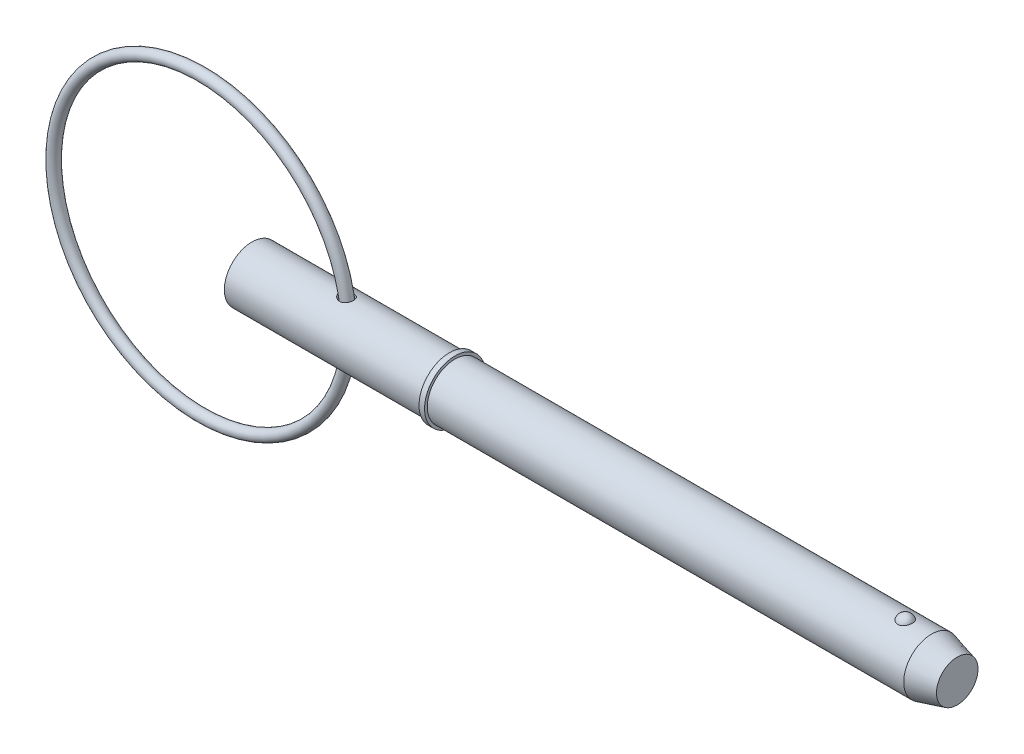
ISO-10303-21;
HEADER;
FILE_DESCRIPTION(('STEP AP214'),'2;1');
FILE_NAME('part.step','',(''),(''),'','','');
FILE_SCHEMA(('AUTOMOTIVE_DESIGN { 1 0 10303 214 1 1 1 1 }'));
ENDSEC;
DATA;
#1=APPLICATION_CONTEXT('core data for automotive mechanical design processes');
#2=APPLICATION_PROTOCOL_DEFINITION('international standard','automotive_design',2000,#1);
#3=PRODUCT_CONTEXT('',#1,'mechanical');
#4=PRODUCT('Part','Part','',(#3));
#5=PRODUCT_RELATED_PRODUCT_CATEGORY('part','',(#4));
#6=PRODUCT_DEFINITION_FORMATION('','',#4);
#7=PRODUCT_DEFINITION_CONTEXT('part definition',#1,'design');
#8=PRODUCT_DEFINITION('design','',#6,#7);
#9=PRODUCT_DEFINITION_SHAPE('','',#8);
#10=(LENGTH_UNIT() NAMED_UNIT(*) SI_UNIT(.MILLI.,.METRE.));
#11=(NAMED_UNIT(*) PLANE_ANGLE_UNIT() SI_UNIT($,.RADIAN.));
#12=(NAMED_UNIT(*) SI_UNIT($,.STERADIAN.) SOLID_ANGLE_UNIT());
#13=UNCERTAINTY_MEASURE_WITH_UNIT(LENGTH_MEASURE(1.E-05),#10,'distance_accuracy_value','');
#14=(GEOMETRIC_REPRESENTATION_CONTEXT(3) GLOBAL_UNCERTAINTY_ASSIGNED_CONTEXT((#13)) GLOBAL_UNIT_ASSIGNED_CONTEXT((#10,
#11,#12)) REPRESENTATION_CONTEXT('',''));
#15=CARTESIAN_POINT('',(0.,0.,0.));
#16=DIRECTION('',(0.,0.,1.));
#17=DIRECTION('',(1.,0.,0.));
#18=AXIS2_PLACEMENT_3D('',#15,#16,#17);
#19=CARTESIAN_POINT('',(-4.3552379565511,0.,0.));
#20=DIRECTION('',(0.,0.,1.));
#21=DIRECTION('',(1.,0.,0.));
#22=AXIS2_PLACEMENT_3D('',#19,#20,#21);
#23=TOROIDAL_SURFACE('',#22,12.7,0.476000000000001);
#24=CARTESIAN_POINT('',(8.8207620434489,0.,0.));
#25=VERTEX_POINT('',#24);
#26=VERTEX_LOOP('',#25);
#27=FACE_BOUND('',#26,.T.);
#28=ADVANCED_FACE('P0_F12',(#27),#23,.T.);
#29=CLOSED_SHELL('',(#28));
#30=MANIFOLD_SOLID_BREP('P0_B1',#29);
#31=CARTESIAN_POINT('',(0.,0.,0.));
#32=DIRECTION('',(1.,0.,0.));
#33=DIRECTION('',(0.,0.,-1.));
#34=AXIS2_PLACEMENT_3D('',#31,#32,#33);
#35=CYLINDRICAL_SURFACE('',#34,2.38);
#36=CARTESIAN_POINT('',(7.65248265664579,2.35074198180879,-0.372037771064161));
#37=CARTESIAN_POINT('',(7.67546616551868,2.34644965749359,-0.399158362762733));
#38=CARTESIAN_POINT('',(7.70081651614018,2.34199234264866,-0.424274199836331));
#39=CARTESIAN_POINT('',(7.75542747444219,2.33326580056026,-0.46990771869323));
#40=CARTESIAN_POINT('',(7.78469342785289,2.32899684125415,-0.49041900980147));
#41=CARTESIAN_POINT('',(7.8462833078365,2.32114904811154,-0.526312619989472));
#42=CARTESIAN_POINT('',(7.87860537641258,2.31756979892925,-0.541698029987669));
#43=CARTESIAN_POINT('',(7.9454452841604,2.31153734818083,-0.566889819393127));
#44=CARTESIAN_POINT('',(7.97996214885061,2.30908365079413,-0.576698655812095));
#45=CARTESIAN_POINT('',(8.05000735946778,2.30564492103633,-0.590297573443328));
#46=CARTESIAN_POINT('',(8.0855275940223,2.30465036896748,-0.594126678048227));
#47=CARTESIAN_POINT('',(8.15670718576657,2.30426876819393,-0.595606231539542));
#48=CARTESIAN_POINT('',(8.1923664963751,2.30488122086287,-0.593258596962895));
#49=CARTESIAN_POINT('',(8.26077822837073,2.30759475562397,-0.582609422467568));
#50=CARTESIAN_POINT('',(8.29358437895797,2.30961492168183,-0.574631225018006));
#51=CARTESIAN_POINT('',(8.35727060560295,2.31483318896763,-0.553233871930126));
#52=CARTESIAN_POINT('',(8.38815097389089,2.31803111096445,-0.53981554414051));
#53=CARTESIAN_POINT('',(8.44618254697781,2.3251225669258,-0.508384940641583));
#54=CARTESIAN_POINT('',(8.47341743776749,2.32899254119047,-0.490521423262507));
#55=CARTESIAN_POINT('',(8.5244826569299,2.33706025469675,-0.450515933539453));
#56=CARTESIAN_POINT('',(8.54831285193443,2.34125800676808,-0.428373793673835));
#57=CARTESIAN_POINT('',(8.5921621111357,2.34956202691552,-0.38020980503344));
#58=CARTESIAN_POINT('',(8.61214543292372,2.35366715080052,-0.354155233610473));
#59=CARTESIAN_POINT('',(8.64754725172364,2.36130301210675,-0.299034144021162));
#60=CARTESIAN_POINT('',(8.66296545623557,2.36483371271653,-0.269967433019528));
#61=CARTESIAN_POINT('',(8.68903776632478,2.37098548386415,-0.209215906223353));
#62=CARTESIAN_POINT('',(8.69962580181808,2.37359383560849,-0.177501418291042));
#63=CARTESIAN_POINT('',(8.71546966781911,2.37755210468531,-0.112692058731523));
#64=CARTESIAN_POINT('',(8.72072552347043,2.37890202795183,-0.0795971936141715));
#65=CARTESIAN_POINT('',(8.72577448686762,2.38019811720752,-0.0129544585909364));
#66=CARTESIAN_POINT('',(8.72556573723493,2.38014380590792,0.0205935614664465));
#67=CARTESIAN_POINT('',(8.71968604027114,2.37863606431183,0.0871753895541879));
#68=CARTESIAN_POINT('',(8.71401506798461,2.37718262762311,0.120209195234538));
#69=CARTESIAN_POINT('',(8.69736472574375,2.37303648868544,0.184779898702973));
#70=CARTESIAN_POINT('',(8.68639268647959,2.37034549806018,0.216318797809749));
#71=CARTESIAN_POINT('',(8.65941400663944,2.36401552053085,0.277063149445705));
#72=CARTESIAN_POINT('',(8.6434071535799,2.36037649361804,0.306268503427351));
#73=CARTESIAN_POINT('',(8.60670627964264,2.35253749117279,0.361595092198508));
#74=CARTESIAN_POINT('',(8.58600040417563,2.34833610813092,0.387708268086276));
#75=CARTESIAN_POINT('',(8.54044852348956,2.33984863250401,0.436017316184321));
#76=CARTESIAN_POINT('',(8.51560272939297,2.33556254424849,0.458213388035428));
#77=CARTESIAN_POINT('',(8.46260111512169,2.32742099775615,0.497916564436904));
#78=CARTESIAN_POINT('',(8.43446763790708,2.32356294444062,0.51545294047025));
#79=CARTESIAN_POINT('',(8.37555109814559,2.31668866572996,0.545520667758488));
#80=CARTESIAN_POINT('',(8.34476845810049,2.31367230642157,0.558052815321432));
#81=CARTESIAN_POINT('',(8.28194930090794,2.30886128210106,0.57763341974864));
#82=CARTESIAN_POINT('',(8.24993988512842,2.30704826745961,0.584764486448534));
#83=CARTESIAN_POINT('',(8.18514558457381,2.30475365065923,0.593744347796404));
#84=CARTESIAN_POINT('',(8.15236068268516,2.30427207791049,0.595593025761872));
#85=CARTESIAN_POINT('',(8.08670515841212,2.30466513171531,0.594069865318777));
#86=CARTESIAN_POINT('',(8.05383545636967,2.30554895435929,0.590662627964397));
#87=CARTESIAN_POINT('',(7.98908593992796,2.30856010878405,0.578780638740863));
#88=CARTESIAN_POINT('',(7.95720636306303,2.31068773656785,0.570304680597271));
#89=CARTESIAN_POINT('',(7.89377258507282,2.31605973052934,0.54809064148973));
#90=CARTESIAN_POINT('',(7.86230095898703,2.31935100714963,0.534128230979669));
#91=CARTESIAN_POINT('',(7.80205133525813,2.32664713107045,0.501391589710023));
#92=CARTESIAN_POINT('',(7.77327429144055,2.33065222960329,0.48261566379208));
#93=CARTESIAN_POINT('',(7.7179634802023,2.3391254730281,0.439760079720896));
#94=CARTESIAN_POINT('',(7.69158313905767,2.3436062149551,0.415484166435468));
#95=CARTESIAN_POINT('',(7.64339516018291,2.35235146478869,0.362706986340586));
#96=CARTESIAN_POINT('',(7.62158727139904,2.35661598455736,0.334205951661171));
#97=CARTESIAN_POINT('',(7.58382605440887,2.36432007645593,0.274368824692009));
#98=CARTESIAN_POINT('',(7.56774982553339,2.36777633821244,0.243112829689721));
#99=CARTESIAN_POINT('',(7.54152169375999,2.3735493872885,0.178112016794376));
#100=CARTESIAN_POINT('',(7.53136536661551,2.3758670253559,0.14436907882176));
#101=CARTESIAN_POINT('',(7.51809691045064,2.37891982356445,0.0783638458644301));
#102=CARTESIAN_POINT('',(7.5144720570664,2.37976992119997,0.0462095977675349));
#103=CARTESIAN_POINT('',(7.51285288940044,2.38014795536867,-0.0182487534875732));
#104=CARTESIAN_POINT('',(7.5148575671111,2.37967612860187,-0.0505528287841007));
#105=CARTESIAN_POINT('',(7.52413867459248,2.37752661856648,-0.112617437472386));
#106=CARTESIAN_POINT('',(7.53113538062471,2.37591295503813,-0.14242285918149));
#107=CARTESIAN_POINT('',(7.5497775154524,2.37172196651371,-0.200451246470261));
#108=CARTESIAN_POINT('',(7.56142049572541,2.3691451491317,-0.228675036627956));
#109=CARTESIAN_POINT('',(7.58571901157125,2.36396321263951,-0.276620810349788));
#110=CARTESIAN_POINT('',(7.59751818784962,2.36150235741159,-0.296799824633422));
#111=CARTESIAN_POINT('',(7.62336661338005,2.35629864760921,-0.33561908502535));
#112=CARTESIAN_POINT('',(7.63741608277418,2.353555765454,-0.354259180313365));
#113=CARTESIAN_POINT('',(7.65248265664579,2.35074198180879,-0.372037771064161));
#114=B_SPLINE_CURVE_WITH_KNOTS('',3,(#36,#37,#38,#39,#40,#41,#42,#43,#44,#45,#46,#47,#48,#49,
#50,#51,#52,#53,#54,#55,#56,#57,#58,#59,#60,#61,#62,#63,#64,#65,#66,#67,#68,#69,#70,#71,#72,#73,
#74,#75,#76,#77,#78,#79,#80,#81,#82,#83,#84,#85,#86,#87,#88,#89,#90,#91,#92,#93,#94,#95,#96,#97,
#98,#99,#100,#101,#102,#103,#104,#105,#106,#107,#108,#109,#110,#111,#112,#113),.UNSPECIFIED.,
.T.,.F.,(4,2,2,2,2,2,2,2,2,2,2,2,2,2,2,2,2,2,2,2,2,2,2,2,2,2,2,2,2,2,2,2,2,2,2,2,2,2,4),(0.,
0.107335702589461,0.214819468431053,0.322238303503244,0.429609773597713,0.536277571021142,
0.642912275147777,0.743874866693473,0.844822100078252,0.942762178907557,1.04070609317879,
1.1395202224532,1.23834068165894,1.33847507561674,1.43860899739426,1.53877695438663,
1.63894536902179,1.73897565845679,1.83901017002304,1.93929990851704,2.03958453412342,
2.13922343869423,2.23884648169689,2.33691317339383,2.4349820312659,2.53371427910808,
2.63247003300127,2.73577311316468,2.83911262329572,2.94697761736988,3.05483668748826,
3.16021984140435,3.26552413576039,3.36212700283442,3.45871257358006,3.55027266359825,
3.64178456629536,3.71214035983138,3.78250304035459),.UNSPECIFIED.);
#115=CARTESIAN_POINT('',(7.65248265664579,2.35074198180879,-0.372037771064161));
#116=VERTEX_POINT('',#115);
#117=EDGE_CURVE('P1_E42',#116,#116,#114,.T.);
#118=ORIENTED_EDGE('',*,*,#117,.T.);
#119=EDGE_LOOP('',(#118));
#120=FACE_BOUND('',#119,.T.);
#121=CARTESIAN_POINT('',(0.,0.,0.));
#122=DIRECTION('',(1.,0.,0.));
#123=DIRECTION('',(0.,0.,-1.));
#124=AXIS2_PLACEMENT_3D('',#121,#122,#123);
#125=CIRCLE('',#124,2.38);
#126=CARTESIAN_POINT('',(0.,0.,-2.38));
#127=VERTEX_POINT('',#126);
#128=EDGE_CURVE('P1_E9',#127,#127,#125,.T.);
#129=ORIENTED_EDGE('',*,*,#128,.T.);
#130=EDGE_LOOP('',(#129));
#131=FACE_BOUND('',#130,.T.);
#132=CARTESIAN_POINT('',(16.974,0.,0.));
#133=DIRECTION('',(1.,0.,0.));
#134=DIRECTION('',(0.,0.,-1.));
#135=AXIS2_PLACEMENT_3D('',#132,#133,#134);
#136=CIRCLE('',#135,2.38);
#137=CARTESIAN_POINT('',(16.974,0.,-2.38));
#138=VERTEX_POINT('',#137);
#139=EDGE_CURVE('P1_E25',#138,#138,#136,.T.);
#140=ORIENTED_EDGE('',*,*,#139,.F.);
#141=EDGE_LOOP('',(#140));
#142=FACE_BOUND('',#141,.T.);
#143=CARTESIAN_POINT('',(7.65248265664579,-2.35074198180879,-0.372037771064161));
#144=CARTESIAN_POINT('',(7.63152023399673,-2.35465684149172,-0.347300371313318));
#145=CARTESIAN_POINT('',(7.61251328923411,-2.35843676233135,-0.320880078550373));
#146=CARTESIAN_POINT('',(7.57904107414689,-2.36534227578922,-0.265218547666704));
#147=CARTESIAN_POINT('',(7.56457485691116,-2.36846800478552,-0.235977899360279));
#148=CARTESIAN_POINT('',(7.54072865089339,-2.37373250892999,-0.175281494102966));
#149=CARTESIAN_POINT('',(7.53136565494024,-2.37586798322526,-0.143818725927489));
#150=CARTESIAN_POINT('',(7.51825775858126,-2.37888184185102,-0.0796854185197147));
#151=CARTESIAN_POINT('',(7.51451093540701,-2.37976065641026,-0.0470152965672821));
#152=CARTESIAN_POINT('',(7.51287230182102,-2.38014359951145,0.0167788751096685));
#153=CARTESIAN_POINT('',(7.51468714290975,-2.37971660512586,0.0478953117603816));
#154=CARTESIAN_POINT('',(7.52344977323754,-2.37768530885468,0.109352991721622));
#155=CARTESIAN_POINT('',(7.53039746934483,-2.37608102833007,0.139694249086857));
#156=CARTESIAN_POINT('',(7.54900783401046,-2.37189301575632,0.198451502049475));
#157=CARTESIAN_POINT('',(7.56061918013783,-2.36931996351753,0.226884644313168));
#158=CARTESIAN_POINT('',(7.58810377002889,-2.36345094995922,0.281524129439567));
#159=CARTESIAN_POINT('',(7.60397804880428,-2.36015481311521,0.307729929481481));
#160=CARTESIAN_POINT('',(7.64062367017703,-2.35291979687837,0.359001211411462));
#161=CARTESIAN_POINT('',(7.66164499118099,-2.34895316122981,0.383883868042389));
#162=CARTESIAN_POINT('',(7.70730875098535,-2.34094029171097,0.430056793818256));
#163=CARTESIAN_POINT('',(7.73195270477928,-2.33689402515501,0.451345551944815));
#164=CARTESIAN_POINT('',(7.78628123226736,-2.32880869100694,0.491427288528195));
#165=CARTESIAN_POINT('',(7.81620889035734,-2.32479472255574,0.509896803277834));
#166=CARTESIAN_POINT('',(7.87876464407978,-2.31758417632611,0.541729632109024));
#167=CARTESIAN_POINT('',(7.91139323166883,-2.31438774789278,0.55509201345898));
#168=CARTESIAN_POINT('',(7.97916670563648,-2.30915137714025,0.576493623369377));
#169=CARTESIAN_POINT('',(8.0143485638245,-2.30713552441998,0.584422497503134));
#170=CARTESIAN_POINT('',(8.08560438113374,-2.30465258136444,0.594140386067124));
#171=CARTESIAN_POINT('',(8.12167802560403,-2.30418495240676,0.595931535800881));
#172=CARTESIAN_POINT('',(8.19193481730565,-2.30488473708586,0.59321801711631));
#173=CARTESIAN_POINT('',(8.2261295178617,-2.30597897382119,0.588995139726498));
#174=CARTESIAN_POINT('',(8.29321509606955,-2.30956729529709,0.574762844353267));
#175=CARTESIAN_POINT('',(8.32610629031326,-2.31206103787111,0.564754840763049));
#176=CARTESIAN_POINT('',(8.38816900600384,-2.31802118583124,0.539753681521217));
#177=CARTESIAN_POINT('',(8.41743993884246,-2.32144077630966,0.52499526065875));
#178=CARTESIAN_POINT('',(8.47302365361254,-2.32890801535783,0.490807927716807));
#179=CARTESIAN_POINT('',(8.49933643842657,-2.33295566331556,0.471379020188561));
#180=CARTESIAN_POINT('',(8.54827790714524,-2.3412242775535,0.428422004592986));
#181=CARTESIAN_POINT('',(8.57091094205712,-2.34544503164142,0.40489880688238));
#182=CARTESIAN_POINT('',(8.61197038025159,-2.35360640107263,0.354387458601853));
#183=CARTESIAN_POINT('',(8.63039647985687,-2.35754699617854,0.32739905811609));
#184=CARTESIAN_POINT('',(8.66284943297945,-2.36478461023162,0.270249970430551));
#185=CARTESIAN_POINT('',(8.67680333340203,-2.36807065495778,0.240046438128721));
#186=CARTESIAN_POINT('',(8.69957181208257,-2.37356560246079,0.177668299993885));
#187=CARTESIAN_POINT('',(8.70838630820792,-2.37577448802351,0.14549366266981));
#188=CARTESIAN_POINT('',(8.72068442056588,-2.37888446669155,0.0799353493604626));
#189=CARTESIAN_POINT('',(8.72414498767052,-2.37977990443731,0.046547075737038));
#190=CARTESIAN_POINT('',(8.72557509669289,-2.38014803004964,-0.0203543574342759));
#191=CARTESIAN_POINT('',(8.72354468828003,-2.37962073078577,-0.0538675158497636));
#192=CARTESIAN_POINT('',(8.71405606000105,-2.37720346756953,-0.119981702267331));
#193=CARTESIAN_POINT('',(8.70661109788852,-2.37531683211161,-0.152584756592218));
#194=CARTESIAN_POINT('',(8.68649336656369,-2.37038779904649,-0.216044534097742));
#195=CARTESIAN_POINT('',(8.67382040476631,-2.36734535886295,-0.24690119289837));
#196=CARTESIAN_POINT('',(8.64352750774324,-2.36042700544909,-0.306062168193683));
#197=CARTESIAN_POINT('',(8.62589743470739,-2.35654938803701,-0.334361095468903));
#198=CARTESIAN_POINT('',(8.58613860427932,-2.34839114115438,-0.387535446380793));
#199=CARTESIAN_POINT('',(8.5640098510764,-2.34411051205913,-0.412410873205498));
#200=CARTESIAN_POINT('',(8.51586484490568,-2.33563475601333,-0.457982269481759));
#201=CARTESIAN_POINT('',(8.48985596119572,-2.33143948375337,-0.478685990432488));
#202=CARTESIAN_POINT('',(8.43462330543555,-2.32360655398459,-0.515369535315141));
#203=CARTESIAN_POINT('',(8.40540000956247,-2.31996881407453,-0.531350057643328));
#204=CARTESIAN_POINT('',(8.34502624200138,-2.31371771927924,-0.557938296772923));
#205=CARTESIAN_POINT('',(8.31391082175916,-2.31108995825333,-0.568622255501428));
#206=CARTESIAN_POINT('',(8.25027207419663,-2.30707117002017,-0.584715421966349));
#207=CARTESIAN_POINT('',(8.21774884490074,-2.30568005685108,-0.590124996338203));
#208=CARTESIAN_POINT('',(8.15238918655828,-2.30427145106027,-0.595601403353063));
#209=CARTESIAN_POINT('',(8.11955499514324,-2.3042474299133,-0.595693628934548));
#210=CARTESIAN_POINT('',(8.05430726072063,-2.30552664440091,-0.590722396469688));
#211=CARTESIAN_POINT('',(8.02189380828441,-2.3068301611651,-0.585657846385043));
#212=CARTESIAN_POINT('',(7.95720150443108,-2.31066076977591,-0.570360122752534));
#213=CARTESIAN_POINT('',(7.92496602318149,-2.31322859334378,-0.55995436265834));
#214=CARTESIAN_POINT('',(7.86260707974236,-2.31930140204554,-0.534242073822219));
#215=CARTESIAN_POINT('',(7.83248403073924,-2.32280656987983,-0.518934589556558));
#216=CARTESIAN_POINT('',(7.77533132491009,-2.33034138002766,-0.483968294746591));
#217=CARTESIAN_POINT('',(7.74827623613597,-2.33436601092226,-0.464349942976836));
#218=CARTESIAN_POINT('',(7.69762060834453,-2.34255524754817,-0.4210920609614));
#219=CARTESIAN_POINT('',(7.67401956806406,-2.34671983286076,-0.397453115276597));
#220=CARTESIAN_POINT('',(7.65248265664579,-2.35074198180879,-0.372037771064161));
#221=B_SPLINE_CURVE_WITH_KNOTS('',3,(#143,#144,#145,#146,#147,#148,#149,#150,#151,#152,#153,
#154,#155,#156,#157,#158,#159,#160,#161,#162,#163,#164,#165,#166,#167,#168,#169,#170,#171,#172,
#173,#174,#175,#176,#177,#178,#179,#180,#181,#182,#183,#184,#185,#186,#187,#188,#189,#190,#191,
#192,#193,#194,#195,#196,#197,#198,#199,#200,#201,#202,#203,#204,#205,#206,#207,#208,#209,#210,
#211,#212,#213,#214,#215,#216,#217,#218,#219,#220),.UNSPECIFIED.,.T.,.F.,(4,2,2,2,2,2,2,2,2,2,2,
2,2,2,2,2,2,2,2,2,2,2,2,2,2,2,2,2,2,2,2,2,2,2,2,2,2,2,4),(0.,0.0978755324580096,
0.19573064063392,0.293909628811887,0.39205499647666,0.48511441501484,0.578172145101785,
0.670232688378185,0.762315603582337,0.860342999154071,0.958411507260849,1.06411708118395,
1.16984195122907,1.27765506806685,1.38543067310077,1.48831936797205,1.59118291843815,
1.68959047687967,1.78799793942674,1.88628818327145,1.98458551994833,2.08441314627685,
2.18424236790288,2.28450017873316,2.38475708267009,2.48476932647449,2.58478525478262,
2.68500723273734,2.78522911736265,2.88526302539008,2.98528213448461,3.08381637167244,
3.18234375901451,3.28040059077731,3.37847819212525,3.4799455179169,3.58143263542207,
3.68200512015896,3.78256299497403),.UNSPECIFIED.);
#222=CARTESIAN_POINT('',(7.65248265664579,-2.35074198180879,-0.372037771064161));
#223=VERTEX_POINT('',#222);
#224=EDGE_CURVE('P1_E17',#223,#223,#221,.T.);
#225=ORIENTED_EDGE('',*,*,#224,.T.);
#226=EDGE_LOOP('',(#225));
#227=FACE_BOUND('',#226,.T.);
#228=ADVANCED_FACE('P1_F13',(#120,#131,#142,#227),#35,.T.);
#229=CARTESIAN_POINT('',(0.,0.,0.));
#230=DIRECTION('',(1.,0.,0.));
#231=DIRECTION('',(0.,0.,-1.));
#232=AXIS2_PLACEMENT_3D('',#229,#230,#231);
#233=CYLINDRICAL_SURFACE('',#232,2.38);
#234=CARTESIAN_POINT('',(58.4094297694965,0.,0.));
#235=DIRECTION('',(1.,0.,0.));
#236=DIRECTION('',(0.,0.,-1.));
#237=AXIS2_PLACEMENT_3D('',#234,#235,#236);
#238=CIRCLE('',#237,2.38);
#239=CARTESIAN_POINT('',(58.4094297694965,0.,-2.38));
#240=VERTEX_POINT('',#239);
#241=EDGE_CURVE('P1_E99',#240,#240,#238,.T.);
#242=ORIENTED_EDGE('',*,*,#241,.F.);
#243=EDGE_LOOP('',(#242));
#244=FACE_BOUND('',#243,.T.);
#245=CARTESIAN_POINT('',(17.45,0.,0.));
#246=DIRECTION('',(1.,0.,0.));
#247=DIRECTION('',(0.,0.,-1.));
#248=AXIS2_PLACEMENT_3D('',#245,#246,#247);
#249=CIRCLE('',#248,2.38);
#250=CARTESIAN_POINT('',(17.45,0.,-2.38));
#251=VERTEX_POINT('',#250);
#252=EDGE_CURVE('P1_E96',#251,#251,#249,.T.);
#253=ORIENTED_EDGE('',*,*,#252,.T.);
#254=EDGE_LOOP('',(#253));
#255=FACE_BOUND('',#254,.T.);
#256=CARTESIAN_POINT('',(56.1634492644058,2.2921568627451,0.640637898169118));
#257=CARTESIAN_POINT('',(56.1303559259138,2.29215737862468,0.640637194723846));
#258=CARTESIAN_POINT('',(56.0972546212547,2.29293179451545,0.637884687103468));
#259=CARTESIAN_POINT('',(56.0320176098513,2.29594030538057,0.626968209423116));
#260=CARTESIAN_POINT('',(55.9998823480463,2.29817506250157,0.618801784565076));
#261=CARTESIAN_POINT('',(55.9375402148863,2.30384308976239,0.597351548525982));
#262=CARTESIAN_POINT('',(55.9073305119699,2.30727454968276,0.584075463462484));
#263=CARTESIAN_POINT('',(55.8495674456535,2.31495941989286,0.552829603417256));
#264=CARTESIAN_POINT('',(55.8220141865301,2.31921286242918,0.534859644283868));
#265=CARTESIAN_POINT('',(55.7695938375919,2.32820213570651,0.494282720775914));
#266=CARTESIAN_POINT('',(55.7448050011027,2.33294694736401,0.471576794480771));
#267=CARTESIAN_POINT('',(55.6992169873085,2.34234144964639,0.422446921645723));
#268=CARTESIAN_POINT('',(55.6784185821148,2.34699112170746,0.396022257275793));
#269=CARTESIAN_POINT('',(55.6403580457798,2.35593942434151,0.338855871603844));
#270=CARTESIAN_POINT('',(55.6233051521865,2.36021170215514,0.30797060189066));
#271=CARTESIAN_POINT('',(55.5943607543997,2.3677057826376,0.243750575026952));
#272=CARTESIAN_POINT('',(55.5824701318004,2.37092740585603,0.210415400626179));
#273=CARTESIAN_POINT('',(55.5638076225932,2.37606901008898,0.141189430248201));
#274=CARTESIAN_POINT('',(55.5571956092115,2.37794816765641,0.105252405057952));
#275=CARTESIAN_POINT('',(55.5498095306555,2.38005135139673,0.0327351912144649));
#276=CARTESIAN_POINT('',(55.5490358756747,2.38027526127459,-0.00384504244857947));
#277=CARTESIAN_POINT('',(55.5533628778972,2.37903842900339,-0.0769838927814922));
#278=CARTESIAN_POINT('',(55.5585202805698,2.37756141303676,-0.113538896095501));
#279=CARTESIAN_POINT('',(55.5747013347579,2.37305303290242,-0.185229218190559));
#280=CARTESIAN_POINT('',(55.5857251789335,2.37002161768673,-0.220364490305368));
#281=CARTESIAN_POINT('',(55.6133977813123,2.36273722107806,-0.288156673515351));
#282=CARTESIAN_POINT('',(55.6300389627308,2.35848588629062,-0.320816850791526));
#283=CARTESIAN_POINT('',(55.6685984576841,2.34923130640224,-0.38274468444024));
#284=CARTESIAN_POINT('',(55.690516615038,2.34422808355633,-0.412012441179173));
#285=CARTESIAN_POINT('',(55.7387549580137,2.33412555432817,-0.465830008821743));
#286=CARTESIAN_POINT('',(55.7650028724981,2.32902887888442,-0.490444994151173));
#287=CARTESIAN_POINT('',(55.8214769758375,2.31926941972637,-0.534700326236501));
#288=CARTESIAN_POINT('',(55.8517022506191,2.3146065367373,-0.554341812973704));
#289=CARTESIAN_POINT('',(55.9140618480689,2.30645675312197,-0.587312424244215));
#290=CARTESIAN_POINT('',(55.9460780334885,2.30293152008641,-0.600855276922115));
#291=CARTESIAN_POINT('',(56.0120795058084,2.29725171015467,-0.622220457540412));
#292=CARTESIAN_POINT('',(56.0460641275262,2.29509667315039,-0.630044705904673));
#293=CARTESIAN_POINT('',(56.113299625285,2.29249264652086,-0.63945294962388));
#294=CARTESIAN_POINT('',(56.1465087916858,2.29196755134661,-0.641315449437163));
#295=CARTESIAN_POINT('',(56.212763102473,2.29246849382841,-0.639522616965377));
#296=CARTESIAN_POINT('',(56.2458082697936,2.29349430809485,-0.635868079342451));
#297=CARTESIAN_POINT('',(56.3101025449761,2.29694059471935,-0.623301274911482));
#298=CARTESIAN_POINT('',(56.3413744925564,2.29933234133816,-0.614497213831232));
#299=CARTESIAN_POINT('',(56.4019952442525,2.30522511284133,-0.592006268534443));
#300=CARTESIAN_POINT('',(56.4313438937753,2.30872622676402,-0.578318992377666));
#301=CARTESIAN_POINT('',(56.4880369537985,2.31655795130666,-0.546112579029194));
#302=CARTESIAN_POINT('',(56.515320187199,2.32090569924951,-0.527490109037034));
#303=CARTESIAN_POINT('',(56.5664904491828,2.32992206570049,-0.486117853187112));
#304=CARTESIAN_POINT('',(56.5903767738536,2.33459075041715,-0.463367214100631));
#305=CARTESIAN_POINT('',(56.6352722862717,2.34399834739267,-0.41322006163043));
#306=CARTESIAN_POINT('',(56.6560972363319,2.34873051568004,-0.385657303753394));
#307=CARTESIAN_POINT('',(56.693056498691,2.35754932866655,-0.327455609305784));
#308=CARTESIAN_POINT('',(56.7091898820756,2.36163584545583,-0.296816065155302));
#309=CARTESIAN_POINT('',(56.7369822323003,2.36889321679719,-0.232047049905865));
#310=CARTESIAN_POINT('',(56.7484450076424,2.37202275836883,-0.197828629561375));
#311=CARTESIAN_POINT('',(56.7657523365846,2.37681926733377,-0.127900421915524));
#312=CARTESIAN_POINT('',(56.7715962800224,2.37848607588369,-0.0921904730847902));
#313=CARTESIAN_POINT('',(56.777605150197,2.38020024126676,-0.019634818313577));
#314=CARTESIAN_POINT('',(56.7776704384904,2.38021918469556,0.0172198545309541));
#315=CARTESIAN_POINT('',(56.7718689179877,2.37856356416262,0.0904219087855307));
#316=CARTESIAN_POINT('',(56.7660018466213,2.37688892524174,0.126769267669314));
#317=CARTESIAN_POINT('',(56.748425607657,2.37201688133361,0.198028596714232));
#318=CARTESIAN_POINT('',(56.736699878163,2.36881516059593,0.232936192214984));
#319=CARTESIAN_POINT('',(56.7076354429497,2.36123444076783,0.300196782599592));
#320=CARTESIAN_POINT('',(56.6902967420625,2.3568554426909,0.332549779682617));
#321=CARTESIAN_POINT('',(56.6505350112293,2.34744667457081,0.393495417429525));
#322=CARTESIAN_POINT('',(56.6281528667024,2.34242227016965,0.42211552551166));
#323=CARTESIAN_POINT('',(56.5787391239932,2.33227293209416,0.475004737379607));
#324=CARTESIAN_POINT('',(56.5517076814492,2.32714800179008,0.4992739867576));
#325=CARTESIAN_POINT('',(56.4944988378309,2.31755359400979,0.542046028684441));
#326=CARTESIAN_POINT('',(56.4644297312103,2.3130698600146,0.560690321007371));
#327=CARTESIAN_POINT('',(56.4013869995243,2.3051412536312,0.592447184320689));
#328=CARTESIAN_POINT('',(56.3684158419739,2.30169550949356,0.60556440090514));
#329=CARTESIAN_POINT('',(56.3068424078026,2.29677744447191,0.623927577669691));
#330=CARTESIAN_POINT('',(56.2785555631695,2.29505839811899,0.630178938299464));
#331=CARTESIAN_POINT('',(56.2213308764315,2.29274795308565,0.638534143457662));
#332=CARTESIAN_POINT('',(56.1923931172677,2.29215641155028,0.64063851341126));
#333=CARTESIAN_POINT('',(56.1634492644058,2.2921568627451,0.640637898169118));
#334=B_SPLINE_CURVE_WITH_KNOTS('',3,(#256,#257,#258,#259,#260,#261,#262,#263,#264,#265,#266,
#267,#268,#269,#270,#271,#272,#273,#274,#275,#276,#277,#278,#279,#280,#281,#282,#283,#284,#285,
#286,#287,#288,#289,#290,#291,#292,#293,#294,#295,#296,#297,#298,#299,#300,#301,#302,#303,#304,
#305,#306,#307,#308,#309,#310,#311,#312,#313,#314,#315,#316,#317,#318,#319,#320,#321,#322,#323,
#324,#325,#326,#327,#328,#329,#330,#331,#332,#333),.UNSPECIFIED.,.T.,.F.,(4,2,2,2,2,2,2,2,2,2,2,
2,2,2,2,2,2,2,2,2,2,2,2,2,2,2,2,2,2,2,2,2,2,2,2,2,2,2,4),(0.,0.0991724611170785,
0.198389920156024,0.297457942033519,0.396529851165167,0.49792776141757,0.599345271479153,
0.705475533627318,0.811623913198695,0.920876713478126,1.03013718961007,1.14045177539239,
1.25076998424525,1.36093998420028,1.47110672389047,1.57959248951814,1.68805336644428,
1.79234266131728,1.89659691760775,1.99590391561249,2.09519661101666,2.19247425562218,
2.28975970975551,2.38926978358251,2.4888004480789,2.59293588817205,2.69709193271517,
2.80525821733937,2.91343624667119,3.02347917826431,3.13352698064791,3.24388765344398,
3.35424823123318,3.46374443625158,3.57323697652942,3.67968690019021,3.7860471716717,
3.87279565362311,3.95953314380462),.UNSPECIFIED.);
#335=CARTESIAN_POINT('',(56.1634492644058,2.2921568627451,0.640637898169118));
#336=VERTEX_POINT('',#335);
#337=EDGE_CURVE('P1_E34',#336,#336,#334,.T.);
#338=ORIENTED_EDGE('',*,*,#337,.T.);
#339=EDGE_LOOP('',(#338));
#340=FACE_BOUND('',#339,.T.);
#341=ADVANCED_FACE('P1_F46',(#244,#255,#340),#233,.T.);
#342=CARTESIAN_POINT('',(0.,0.,0.));
#343=DIRECTION('',(-1.,0.,0.));
#344=DIRECTION('',(0.,0.,1.));
#345=AXIS2_PLACEMENT_3D('',#342,#343,#344);
#346=PLANE('',#345);
#347=ORIENTED_EDGE('',*,*,#128,.F.);
#348=EDGE_LOOP('',(#347));
#349=FACE_BOUND('',#348,.T.);
#350=ADVANCED_FACE('P1_F15',(#349),#346,.T.);
#351=CARTESIAN_POINT('',(16.974,2.38,0.));
#352=DIRECTION('',(-1.,0.,0.));
#353=DIRECTION('',(0.,0.,1.));
#354=AXIS2_PLACEMENT_3D('',#351,#352,#353);
#355=PLANE('',#354);
#356=ORIENTED_EDGE('',*,*,#139,.T.);
#357=EDGE_LOOP('',(#356));
#358=FACE_BOUND('',#357,.T.);
#359=CARTESIAN_POINT('',(16.974,0.,0.));
#360=DIRECTION('',(1.,0.,0.));
#361=DIRECTION('',(0.,0.,-1.));
#362=AXIS2_PLACEMENT_3D('',#359,#360,#361);
#363=CIRCLE('',#362,2.618);
#364=CARTESIAN_POINT('',(16.974,0.,-2.618));
#365=VERTEX_POINT('',#364);
#366=EDGE_CURVE('P1_E30',#365,#365,#363,.T.);
#367=ORIENTED_EDGE('',*,*,#366,.F.);
#368=EDGE_LOOP('',(#367));
#369=FACE_BOUND('',#368,.T.);
#370=ADVANCED_FACE('P1_F81',(#358,#369),#355,.T.);
#371=CARTESIAN_POINT('',(0.,0.,0.));
#372=DIRECTION('',(1.,0.,0.));
#373=DIRECTION('',(0.,0.,-1.));
#374=AXIS2_PLACEMENT_3D('',#371,#372,#373);
#375=CYLINDRICAL_SURFACE('',#374,2.618);
#376=ORIENTED_EDGE('',*,*,#366,.T.);
#377=EDGE_LOOP('',(#376));
#378=FACE_BOUND('',#377,.T.);
#379=CARTESIAN_POINT('',(17.45,0.,0.));
#380=DIRECTION('',(1.,0.,0.));
#381=DIRECTION('',(0.,0.,-1.));
#382=AXIS2_PLACEMENT_3D('',#379,#380,#381);
#383=CIRCLE('',#382,2.618);
#384=CARTESIAN_POINT('',(17.45,0.,-2.618));
#385=VERTEX_POINT('',#384);
#386=EDGE_CURVE('P1_E95',#385,#385,#383,.T.);
#387=ORIENTED_EDGE('',*,*,#386,.F.);
#388=EDGE_LOOP('',(#387));
#389=FACE_BOUND('',#388,.T.);
#390=ADVANCED_FACE('P1_F68',(#378,#389),#375,.T.);
#391=CARTESIAN_POINT('',(17.45,2.618,0.));
#392=DIRECTION('',(1.,0.,0.));
#393=DIRECTION('',(0.,0.,-1.));
#394=AXIS2_PLACEMENT_3D('',#391,#392,#393);
#395=PLANE('',#394);
#396=ORIENTED_EDGE('',*,*,#386,.T.);
#397=EDGE_LOOP('',(#396));
#398=FACE_BOUND('',#397,.T.);
#399=ORIENTED_EDGE('',*,*,#252,.F.);
#400=EDGE_LOOP('',(#399));
#401=FACE_BOUND('',#400,.T.);
#402=ADVANCED_FACE('P1_F62',(#398,#401),#395,.T.);
#403=CARTESIAN_POINT('',(60.63,0.,0.));
#404=DIRECTION('',(-1.,0.,0.));
#405=DIRECTION('',(0.,0.,1.));
#406=AXIS2_PLACEMENT_3D('',#403,#404,#405);
#407=CONICAL_SURFACE('',#406,1.78500000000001,0.26179938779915);
#408=ORIENTED_EDGE('',*,*,#241,.T.);
#409=EDGE_LOOP('',(#408));
#410=FACE_BOUND('',#409,.T.);
#411=CARTESIAN_POINT('',(60.63,0.,0.));
#412=DIRECTION('',(1.,0.,0.));
#413=DIRECTION('',(0.,0.,-1.));
#414=AXIS2_PLACEMENT_3D('',#411,#412,#413);
#415=CIRCLE('',#414,1.78500000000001);
#416=CARTESIAN_POINT('',(60.63,0.,-1.78500000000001));
#417=VERTEX_POINT('',#416);
#418=EDGE_CURVE('P1_E41',#417,#417,#415,.T.);
#419=ORIENTED_EDGE('',*,*,#418,.F.);
#420=EDGE_LOOP('',(#419));
#421=FACE_BOUND('',#420,.T.);
#422=ADVANCED_FACE('P1_F59',(#410,#421),#407,.T.);
#423=CARTESIAN_POINT('',(60.63,1.78500000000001,0.));
#424=DIRECTION('',(1.,0.,0.));
#425=DIRECTION('',(0.,0.,-1.));
#426=AXIS2_PLACEMENT_3D('',#423,#424,#425);
#427=PLANE('',#426);
#428=ORIENTED_EDGE('',*,*,#418,.T.);
#429=EDGE_LOOP('',(#428));
#430=FACE_BOUND('',#429,.T.);
#431=ADVANCED_FACE('P1_F55',(#430),#427,.T.);
#432=CARTESIAN_POINT('',(56.1634492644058,2.14199999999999,0.));
#433=DIRECTION('',(-1.,0.,0.));
#434=DIRECTION('',(0.,-1.,0.));
#435=AXIS2_PLACEMENT_3D('',#432,#433,#434);
#436=SPHERICAL_SURFACE('',#435,0.657999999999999);
#437=ORIENTED_EDGE('',*,*,#337,.F.);
#438=EDGE_LOOP('',(#437));
#439=FACE_BOUND('',#438,.T.);
#440=ADVANCED_FACE('P1_F50',(#439),#436,.T.);
#441=CARTESIAN_POINT('',(-4.3552379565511,0.,0.));
#442=DIRECTION('',(0.,0.,1.));
#443=DIRECTION('',(1.,0.,0.));
#444=AXIS2_PLACEMENT_3D('',#441,#442,#443);
#445=TOROIDAL_SURFACE('',#444,12.7,0.594999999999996);
#446=ORIENTED_EDGE('',*,*,#224,.F.);
#447=EDGE_LOOP('',(#446));
#448=FACE_BOUND('',#447,.T.);
#449=ORIENTED_EDGE('',*,*,#117,.F.);
#450=EDGE_LOOP('',(#449));
#451=FACE_BOUND('',#450,.T.);
#452=ADVANCED_FACE('P1_F54',(#448,#451),#445,.F.);
#453=CLOSED_SHELL('',(#228,#341,#350,#370,#390,#402,#422,#431,#440,#452));
#454=MANIFOLD_SOLID_BREP('P1_B1',#453);
#455=ADVANCED_BREP_SHAPE_REPRESENTATION('',(#18,#30,#454),#14);
#456=SHAPE_DEFINITION_REPRESENTATION(#9,#455);
ENDSEC;
END-ISO-10303-21;
